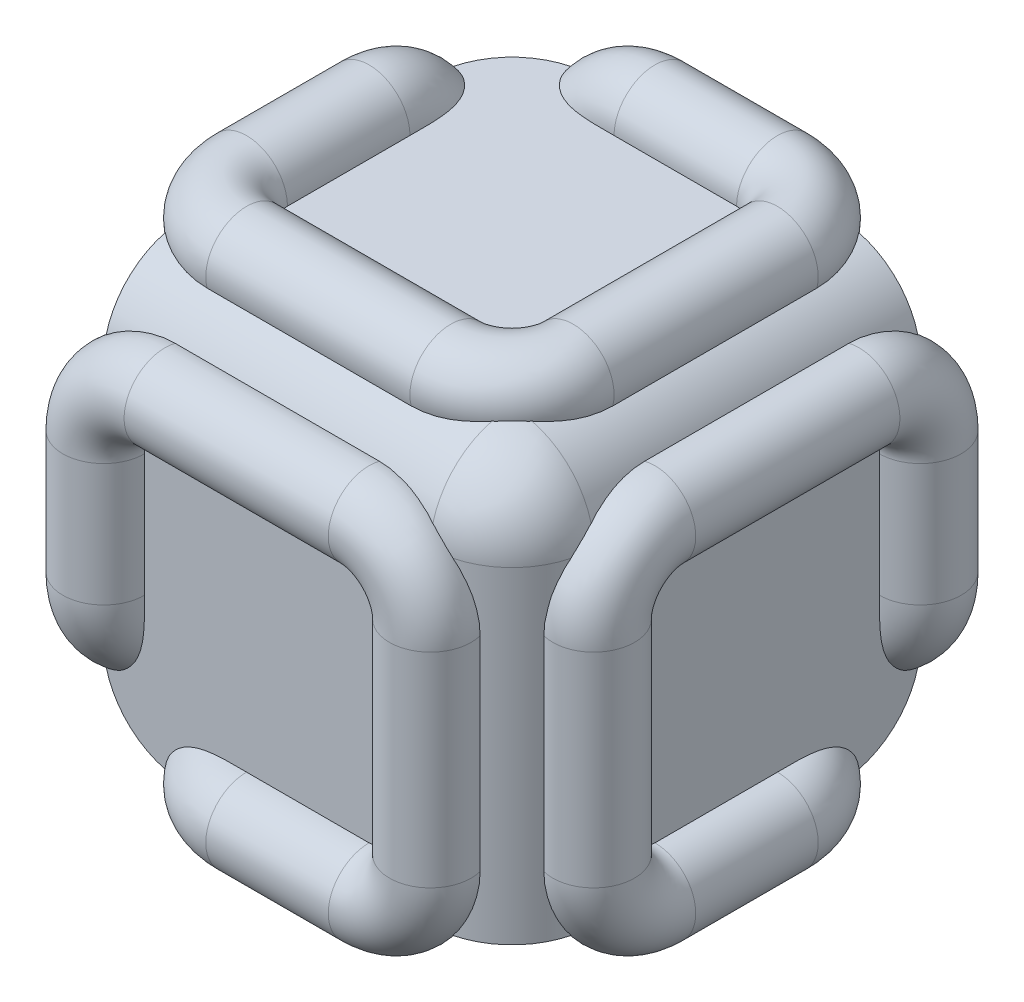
from build123d import *

# Parameters (mm, degrees)
SKETCH1_W           = 100
SKETCH1_H           = 100
BOSS_EXTRUDE1_DEPTH = 100
FILLET1_R           = 20
SKETCH2_R           = 10


with BuildPart() as part:
    # Sketch1 → Boss-Extrude1 (new body)
    with BuildSketch(Plane(origin=(0, 0, 0), x_dir=(1, 0, 0), z_dir=(0, 1, 0))):
        with Locations((50, 50)):
            Rectangle(SKETCH1_W, SKETCH1_H)
    extrude(amount=BOSS_EXTRUDE1_DEPTH)

    # Fillet1
    fillet1_edges = [part.edges().sort_by_distance(p)[0] for p in [
        (100, 100, -50),
        (50, 0, -100),
        (0, 0, -50),
        (50, 100, 0),
        (0, 50, -100),
        (100, 50, 0),
    ]]
    fillet(fillet1_edges, radius=FILLET1_R)


with BuildPart() as body_2:
    # Sweep1: sweep along a curve in space
    with BuildLine() as sweep1_path:
        Line((65, 100, -100), (35, 100, -100))
        ThreePointArc((35, 100, -100), (24.393398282, 95.606601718, -100), (20, 85, -100))
        Line((20, 85, -100), (20, 35, -100))
        ThreePointArc((35, 20, -100), (24.393398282, 24.393398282, -100), (20, 35, -100))
        Line((35, 20, -100), (85, 20, -100))
        ThreePointArc((85, 20, -100), (95.606601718, 24.393398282, -100), (100, 35, -100))
        Line((100, 35, -100), (100, 65, -100))
        ThreePointArc((100, 80, -85), (100, 75.606601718, -95.606601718), (100, 65, -100))
        Line((100, 80, -85), (100, 80, -35))
        ThreePointArc((100, 80, -35), (100, 75.606601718, -24.393398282), (100, 65, -20))
        Line((100, 65, -20), (100, 15, -20))
        ThreePointArc((100, 15, -20), (100, 4.393398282, -24.393398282), (100, 0, -35))
        Line((100, 0, -65), (100, 0, -35))
        ThreePointArc((100, 0, -65), (95.606601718, 0, -75.606601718), (85, 0, -80))
        Line((85, 0, -80), (35, 0, -80))
        ThreePointArc((35, 0, -80), (24.393398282, 0, -75.606601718), (20, 0, -65))
        Line((20, 0, -65), (20, 0, -15))
        ThreePointArc((20, 0, -15), (24.393398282, 0, -4.393398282), (35, 0, 0))
        Line((35, 0, 0), (65, 0, 0))
        ThreePointArc((65, 0, 0), (75.606601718, 4.393398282, 0), (80, 15, 0))
        Line((80, 15, 0), (80, 65, 0))
        ThreePointArc((80, 65, 0), (75.606601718, 75.606601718, 0), (65, 80, 0))
        Line((65, 80, 0), (15, 80, 0))
        ThreePointArc((15, 80, 0), (4.393398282, 75.606601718, 0), (0, 65, 0))
        Line((0, 65, 0), (0, 35, 0))
        ThreePointArc((0, 35, 0), (0, 24.393398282, -4.393398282), (0, 20, -15))
        Line((0, 20, -15), (0, 20, -65))
        ThreePointArc((0, 20, -65), (0, 24.393398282, -75.606601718), (0, 35, -80))
        Line((0, 35, -80), (0, 85, -80))
        ThreePointArc((0, 85, -80), (0, 95.606601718, -75.606601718), (0, 100, -65))
        Line((0, 100, -65), (0, 100, -35))
        ThreePointArc((15, 100, -20), (4.393398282, 100, -24.393398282), (0, 100, -35))
        Line((15, 100, -20), (65, 100, -20))
        ThreePointArc((65, 100, -20), (75.606601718, 100, -24.393398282), (80, 100, -35))
        Line((80, 100, -35), (80, 100, -85))
        ThreePointArc((80, 100, -85), (75.606601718, 100, -95.606601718), (65, 100, -100))
    # Sketch2 → Sweep1 (sweep)
    with BuildSketch(Plane(origin=(20, 35, -100), x_dir=(-1, 0, 0), z_dir=(0, -1, 0))):
        Circle(SKETCH2_R)
    sweep(path=sweep1_path.line)


solid = Compound([part.part, body_2.part])
